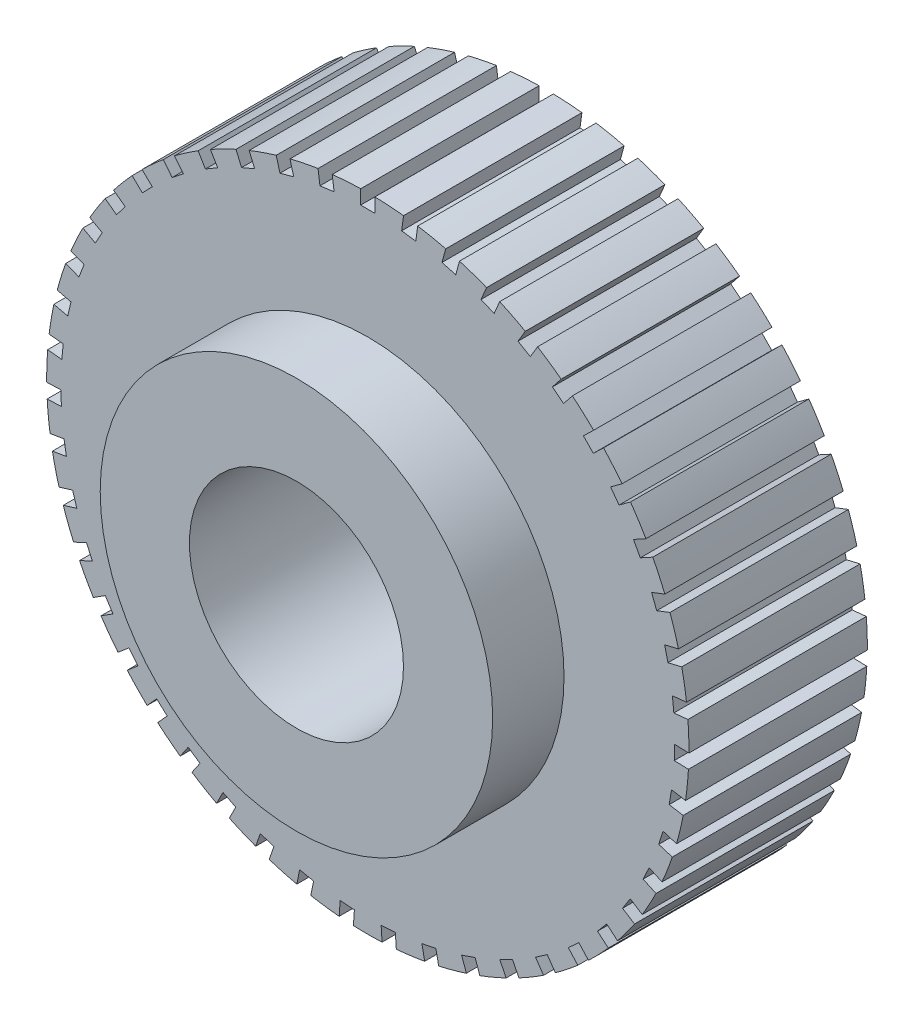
from build123d import *

# Parameters (mm, degrees)
ESQUISSE1_R                  = 9
BASE_EXTRUSION_DEPTH         = 5
ESQUISSE2_R                  = 5.5
BOSS_EXTRU_1_DEPTH           = 2
ESQUISSE3_R                  = 3
ENL_V_MAT_EXTRU_1_DEPTH      = 12
ENL_V_MAT_EXTRU_2_DEPTH      = 12
R_P_TITION_CIRCULAIRE1_COUNT = 47
R_P_TITION_CIRCULAIRE1_ANGLE = 352.36


with BuildPart() as part:
    # Esquisse1 → Base-Extrusion (new body)
    with BuildSketch(Plane.XY):
        Circle(ESQUISSE1_R)
    extrude(amount=BASE_EXTRUSION_DEPTH)

    # Esquisse2 → Boss.-Extru.1 (add)
    with BuildSketch(Plane.XY.offset(5)):
        Circle(ESQUISSE2_R)
    extrude(amount=BOSS_EXTRU_1_DEPTH)

    # Esquisse3 → Enl_v. mat.-Extru.1 (cut)
    with BuildSketch(Plane.XY.offset(7)):
        Circle(ESQUISSE3_R)
    extrude(amount=-ENL_V_MAT_EXTRU_1_DEPTH, mode=Mode.SUBTRACT)

    # Esquisse4 → Enl_v. mat.-Extru.2 (cut)
    with BuildSketch(Plane(origin=(0, 0, 0), x_dir=(-1, 0, 0), z_dir=(0, 0, -1))):
        Polygon((-0.2, 8.8), (-0.2, 8.6), (0.2, 8.6), (0.2, 8.8), (0.2, 9.2), (0, 9.2), (-0.2, 9.2), align=None)
    enl_v_mat_extru_2 = extrude(amount=-ENL_V_MAT_EXTRU_2_DEPTH, mode=Mode.SUBTRACT)

    # R_p_tition circulaire1: Enl_v. mat.-Extru.2 ×47 about axis
    r_p_tition_circulaire1_axis = Axis((0, 0, 0), (0, 0, -1))
    for i in range(1, R_P_TITION_CIRCULAIRE1_COUNT):
        add(enl_v_mat_extru_2.rotate(r_p_tition_circulaire1_axis, i * R_P_TITION_CIRCULAIRE1_ANGLE / (R_P_TITION_CIRCULAIRE1_COUNT - 1)), mode=Mode.SUBTRACT)


solid = part.part
